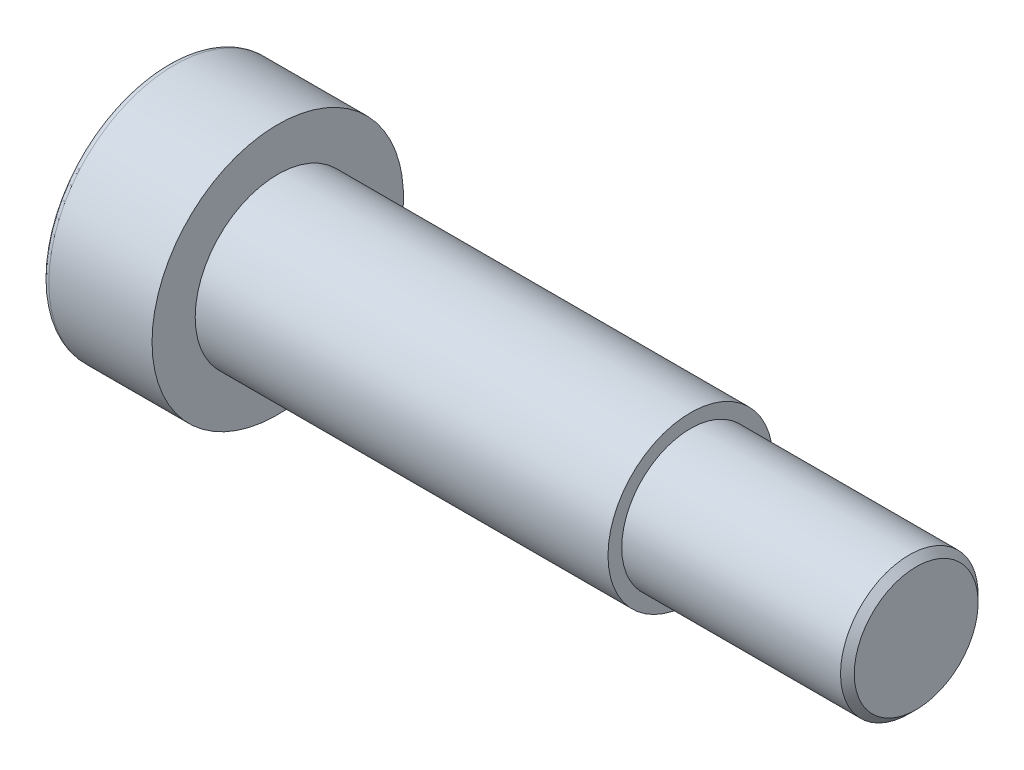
from build123d import *

# Parameters (mm, degrees)
CHANFREIN1_SIZE         = 0.5
CONG_1_R                = 0.5
ENL_V_MAT_EXTRU_1_DEPTH = 5


with BuildPart() as part:
    # Esquisse1 → Base-R_volution (revolve)
    with BuildSketch(Plane.XY, mode=Mode.PRIVATE) as base_r_volution_sk:
        Polygon((0, 0), (0, 9.135), (8, 9.135), (8, 6), (38, 6), (38, 5), (54.4, 5), (54.4, 0), align=None)
    revolve(base_r_volution_sk.sketch.rotate(Axis((-16.779082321, 0, 0), (1, 0, 0)), 90), axis=Axis((-16.779082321, 0, 0), (1, 0, 0)))

    # Chanfrein1
    chanfrein1_edges = [part.edges().sort_by_distance(p)[0] for p in [
        (54.4, 0, -5),
    ]]
    chamfer(chanfrein1_edges, length=CHANFREIN1_SIZE)

    # Cong_1
    cong_1_edges = [part.edges().sort_by_distance(p)[0] for p in [
        (0, 0, -9.135),
    ]]
    fillet(cong_1_edges, radius=CONG_1_R)

    # Esquisse2 → Enl_v. mat.-Extru.1 (cut)
    with BuildSketch(Plane.ZY):
        Polygon((-1.732050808, 3), (1.732050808, 3), (3.464101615, 0), (1.732050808, -3), (-1.732050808, -3), (-3.464101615, 0), align=None)
    extrude(amount=-ENL_V_MAT_EXTRU_1_DEPTH, mode=Mode.SUBTRACT)


solid = part.part
